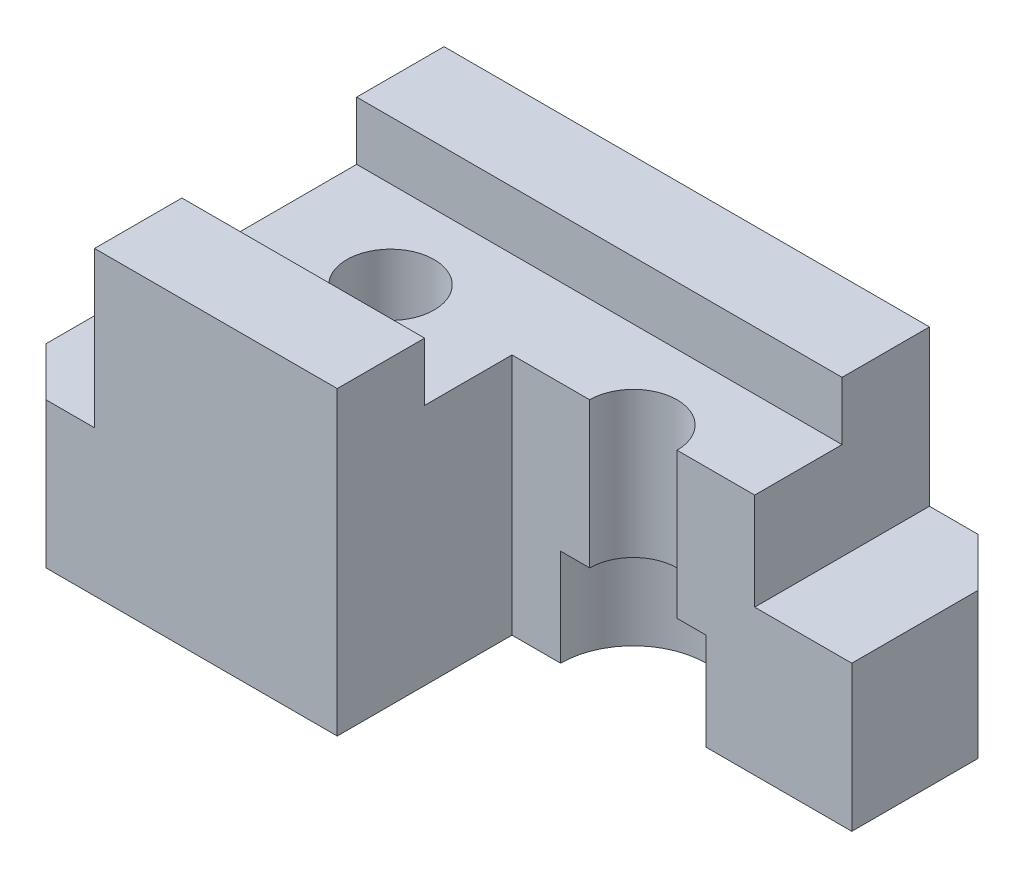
from build123d import *

# Parameters (mm, degrees)
BASE_EXTRUSION_DEPTH    = 36
ESQUISSE2_R             = 7.5
ENL_V_MAT_EXTRU_1_DEPTH = 10
ENL_V_START             = -21
ESQUISSE3_R             = 4.5
ENL_V_MAT_EXTRU_5_DEPTH = 21
ESQUISSE4_W             = 18
ESQUISSE4_H             = 7.016444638
ENL_V_MAT_EXTRU_6_DEPTH = 77.531039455
CHANFREIN1_SIZE         = 5
ESQUISSE7_W             = 36.806314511
ESQUISSE7_H             = 35.786278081
ENL_V_MAT_EXTRU_7_DEPTH = 18


with BuildPart() as part:
    # Esquisse1 → Base-Extrusion (new body)
    with BuildSketch(Plane.XY):
        Polygon((0, 0), (0, 15), (10, 15), (10, 31), (60, 31), (60, 15), (70, 15), (70, 0), align=None)
    extrude(amount=-BASE_EXTRUSION_DEPTH)

    # Esquisse2 → Enl_v. mat.-Extru.1 (cut)
    with BuildSketch(Plane.XZ):
        with Locations((22.5, -18)):
            Circle(ESQUISSE2_R)
        with Locations((47.5, -18)):
            Circle(ESQUISSE2_R)
    extrude(amount=-ENL_V_MAT_EXTRU_1_DEPTH, mode=Mode.SUBTRACT)

    # Esquisse3 → Enl_v. mat.-Extru.5 (cut)
    with BuildSketch(Plane.XZ.offset(-10).offset(ENL_V_START)):
        with Locations((22.48458693, -18)):
            Circle(ESQUISSE3_R)
        with Locations((47.5, -18)):
            Circle(ESQUISSE3_R)
    extrude(amount=ENL_V_MAT_EXTRU_5_DEPTH, mode=Mode.SUBTRACT)

    # Esquisse4 → Enl_v. mat.-Extru.6 (cut, through all)
    with BuildSketch(Plane(origin=(60, 0, 0), x_dir=(0, 0, -1), z_dir=(1, 0, 0))):
        with Locations((18, 28.508222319)):
            Rectangle(ESQUISSE4_W, ESQUISSE4_H)
    extrude(amount=-ENL_V_MAT_EXTRU_6_DEPTH, mode=Mode.SUBTRACT)

    # Chanfrein1
    chanfrein1_edges = [part.edges().sort_by_distance(p)[0] for p in [
        (0, 7.5, -36),
        (70, 7.5, -36),
        (70, 7.5, 0),
        (0, 7.5, 0),
    ]]
    chamfer(chanfrein1_edges, length=CHANFREIN1_SIZE)

    # Esquisse7 → Enl_v. mat.-Extru.7 (cut)
    with BuildSketch(Plane.XY):
        with Locations((53.403157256, 16.222525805)):
            Rectangle(ESQUISSE7_W, ESQUISSE7_H)
    extrude(amount=-ENL_V_MAT_EXTRU_7_DEPTH, mode=Mode.SUBTRACT)


solid = part.part
